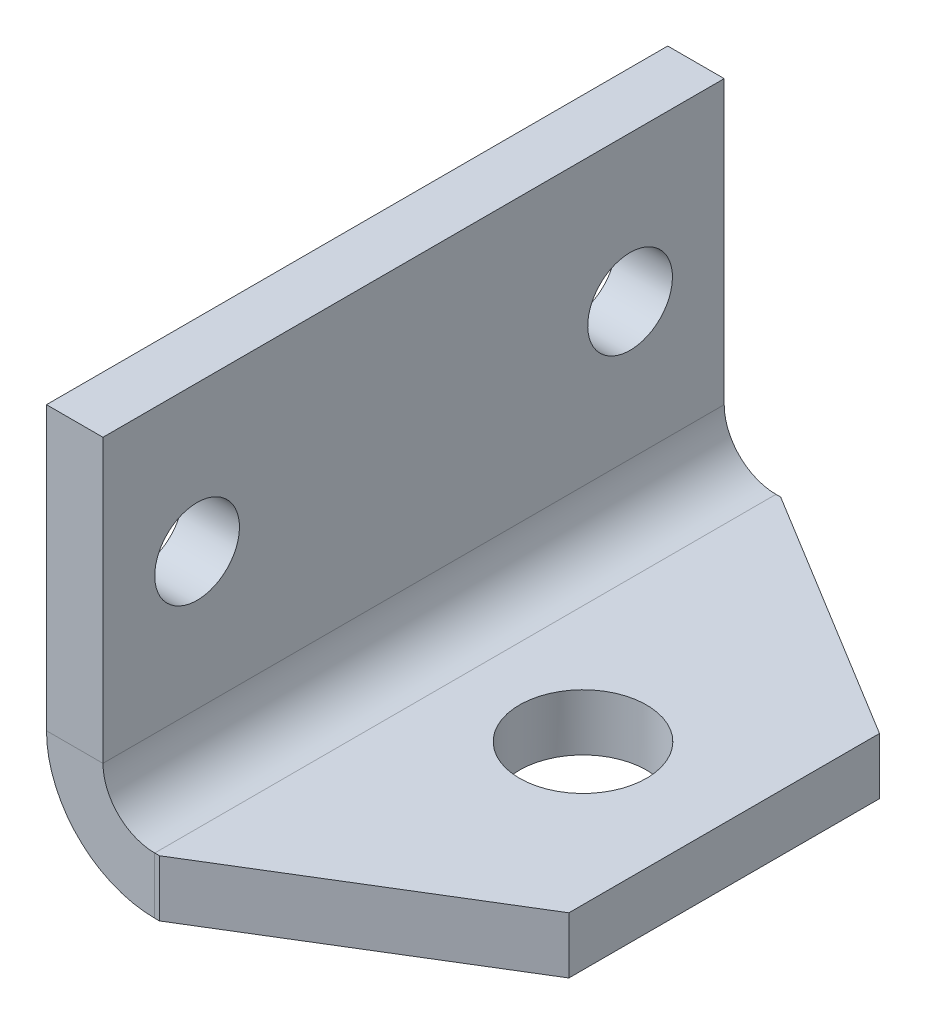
ISO-10303-21;
HEADER;
FILE_DESCRIPTION(('STEP AP214'),'2;1');
FILE_NAME('part.step','',(''),(''),'','','');
FILE_SCHEMA(('AUTOMOTIVE_DESIGN { 1 0 10303 214 1 1 1 1 }'));
ENDSEC;
DATA;
#1=APPLICATION_CONTEXT('core data for automotive mechanical design processes');
#2=APPLICATION_PROTOCOL_DEFINITION('international standard','automotive_design',2000,#1);
#3=PRODUCT_CONTEXT('',#1,'mechanical');
#4=PRODUCT('Part','Part','',(#3));
#5=PRODUCT_RELATED_PRODUCT_CATEGORY('part','',(#4));
#6=PRODUCT_DEFINITION_FORMATION('','',#4);
#7=PRODUCT_DEFINITION_CONTEXT('part definition',#1,'design');
#8=PRODUCT_DEFINITION('design','',#6,#7);
#9=PRODUCT_DEFINITION_SHAPE('','',#8);
#10=(LENGTH_UNIT() NAMED_UNIT(*) SI_UNIT(.MILLI.,.METRE.));
#11=(NAMED_UNIT(*) PLANE_ANGLE_UNIT() SI_UNIT($,.RADIAN.));
#12=(NAMED_UNIT(*) SI_UNIT($,.STERADIAN.) SOLID_ANGLE_UNIT());
#13=UNCERTAINTY_MEASURE_WITH_UNIT(LENGTH_MEASURE(1.E-05),#10,'distance_accuracy_value','');
#14=(GEOMETRIC_REPRESENTATION_CONTEXT(3) GLOBAL_UNCERTAINTY_ASSIGNED_CONTEXT((#13)) GLOBAL_UNIT_ASSIGNED_CONTEXT((#10,
#11,#12)) REPRESENTATION_CONTEXT('',''));
#15=CARTESIAN_POINT('',(0.,0.,0.));
#16=DIRECTION('',(0.,0.,1.));
#17=DIRECTION('',(1.,0.,0.));
#18=AXIS2_PLACEMENT_3D('',#15,#16,#17);
#19=CARTESIAN_POINT('',(0.,0.,-132.));
#20=DIRECTION('',(0.,-1.,0.));
#21=DIRECTION('',(0.,0.,-1.));
#22=AXIS2_PLACEMENT_3D('',#19,#20,#21);
#23=PLANE('',#22);
#24=CARTESIAN_POINT('',(48.,0.,-66.));
#25=DIRECTION('',(0.,-1.,0.));
#26=DIRECTION('',(0.,0.,-1.));
#27=AXIS2_PLACEMENT_3D('',#24,#25,#26);
#28=CIRCLE('',#27,13.5);
#29=CARTESIAN_POINT('',(48.,0.,-79.5));
#30=VERTEX_POINT('',#29);
#31=EDGE_CURVE('E141',#30,#30,#28,.T.);
#32=ORIENTED_EDGE('',*,*,#31,.F.);
#33=EDGE_LOOP('',(#32));
#34=FACE_BOUND('',#33,.T.);
#35=DIRECTION('',(-0.853281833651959,0.,-0.521450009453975));
#36=VECTOR('',#35,1.);
#37=CARTESIAN_POINT('',(6.5258426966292,0.,-142.678651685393));
#38=LINE('',#37,#36);
#39=CARTESIAN_POINT('',(78.,0.,-99.));
#40=VERTEX_POINT('',#39);
#41=CARTESIAN_POINT('',(24.,0.,-132.));
#42=VERTEX_POINT('',#41);
#43=EDGE_CURVE('E47',#40,#42,#38,.T.);
#44=ORIENTED_EDGE('',*,*,#43,.F.);
#45=DIRECTION('',(0.,0.,1.));
#46=VECTOR('',#45,1.);
#47=CARTESIAN_POINT('',(78.,0.,-132.));
#48=LINE('',#47,#46);
#49=CARTESIAN_POINT('',(78.,0.,-33.));
#50=VERTEX_POINT('',#49);
#51=EDGE_CURVE('E145',#40,#50,#48,.T.);
#52=ORIENTED_EDGE('',*,*,#51,.T.);
#53=DIRECTION('',(0.853281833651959,0.,-0.521450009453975));
#54=VECTOR('',#53,1.);
#55=CARTESIAN_POINT('',(65.2584269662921,0.,-25.2134831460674));
#56=LINE('',#55,#54);
#57=CARTESIAN_POINT('',(24.,0.,0.));
#58=VERTEX_POINT('',#57);
#59=EDGE_CURVE('E147',#58,#50,#56,.T.);
#60=ORIENTED_EDGE('',*,*,#59,.F.);
#61=DIRECTION('',(1.,0.,0.));
#62=VECTOR('',#61,1.);
#63=CARTESIAN_POINT('',(0.,0.,0.));
#64=LINE('',#63,#62);
#65=CARTESIAN_POINT('',(23.,0.,0.));
#66=VERTEX_POINT('',#65);
#67=EDGE_CURVE('E150',#66,#58,#64,.T.);
#68=ORIENTED_EDGE('',*,*,#67,.F.);
#69=DIRECTION('',(0.,0.,1.));
#70=VECTOR('',#69,1.);
#71=CARTESIAN_POINT('',(23.,0.,-132.));
#72=LINE('',#71,#70);
#73=CARTESIAN_POINT('',(23.,0.,-132.));
#74=VERTEX_POINT('',#73);
#75=EDGE_CURVE('E152',#66,#74,#72,.F.);
#76=ORIENTED_EDGE('',*,*,#75,.T.);
#77=DIRECTION('',(1.,0.,0.));
#78=VECTOR('',#77,1.);
#79=CARTESIAN_POINT('',(0.,0.,-132.));
#80=LINE('',#79,#78);
#81=EDGE_CURVE('E155',#74,#42,#80,.T.);
#82=ORIENTED_EDGE('',*,*,#81,.T.);
#83=EDGE_LOOP('',(#44,#52,#60,#68,#76,#82));
#84=FACE_BOUND('',#83,.T.);
#85=ADVANCED_FACE('F24',(#34,#84),#23,.T.);
#86=CARTESIAN_POINT('',(48.,-120.,-66.));
#87=DIRECTION('',(0.,1.,0.));
#88=DIRECTION('',(0.,0.,1.));
#89=AXIS2_PLACEMENT_3D('',#86,#87,#88);
#90=CYLINDRICAL_SURFACE('',#89,13.5);
#91=ORIENTED_EDGE('',*,*,#31,.T.);
#92=EDGE_LOOP('',(#91));
#93=FACE_BOUND('',#92,.T.);
#94=CARTESIAN_POINT('',(48.,12.,-66.));
#95=DIRECTION('',(0.,1.,0.));
#96=DIRECTION('',(0.,0.,1.));
#97=AXIS2_PLACEMENT_3D('',#94,#95,#96);
#98=CIRCLE('',#97,13.5);
#99=CARTESIAN_POINT('',(48.,12.,-52.5));
#100=VERTEX_POINT('',#99);
#101=EDGE_CURVE('E187',#100,#100,#98,.T.);
#102=ORIENTED_EDGE('',*,*,#101,.T.);
#103=EDGE_LOOP('',(#102));
#104=FACE_BOUND('',#103,.T.);
#105=ADVANCED_FACE('F243',(#93,#104),#90,.F.);
#106=CARTESIAN_POINT('',(12.,12.,-132.));
#107=DIRECTION('',(0.,1.,0.));
#108=DIRECTION('',(0.,0.,1.));
#109=AXIS2_PLACEMENT_3D('',#106,#107,#108);
#110=PLANE('',#109);
#111=ORIENTED_EDGE('',*,*,#101,.F.);
#112=EDGE_LOOP('',(#111));
#113=FACE_BOUND('',#112,.T.);
#114=DIRECTION('',(0.853281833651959,0.,0.521450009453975));
#115=VECTOR('',#114,1.);
#116=CARTESIAN_POINT('',(78.,12.,-99.));
#117=LINE('',#116,#115);
#118=CARTESIAN_POINT('',(24.,12.,-132.));
#119=VERTEX_POINT('',#118);
#120=CARTESIAN_POINT('',(78.,12.,-99.));
#121=VERTEX_POINT('',#120);
#122=EDGE_CURVE('E224',#119,#121,#117,.T.);
#123=ORIENTED_EDGE('',*,*,#122,.F.);
#124=DIRECTION('',(-1.,0.,0.));
#125=VECTOR('',#124,1.);
#126=CARTESIAN_POINT('',(12.,12.,-132.));
#127=LINE('',#126,#125);
#128=CARTESIAN_POINT('',(23.,12.,-132.));
#129=VERTEX_POINT('',#128);
#130=EDGE_CURVE('E129',#119,#129,#127,.T.);
#131=ORIENTED_EDGE('',*,*,#130,.T.);
#132=DIRECTION('',(0.,0.,1.));
#133=VECTOR('',#132,1.);
#134=CARTESIAN_POINT('',(23.,12.,0.));
#135=LINE('',#134,#133);
#136=CARTESIAN_POINT('',(23.,12.,0.));
#137=VERTEX_POINT('',#136);
#138=EDGE_CURVE('E118',#129,#137,#135,.T.);
#139=ORIENTED_EDGE('',*,*,#138,.T.);
#140=DIRECTION('',(-1.,0.,0.));
#141=VECTOR('',#140,1.);
#142=CARTESIAN_POINT('',(12.,12.,0.));
#143=LINE('',#142,#141);
#144=CARTESIAN_POINT('',(24.,12.,0.));
#145=VERTEX_POINT('',#144);
#146=EDGE_CURVE('E127',#145,#137,#143,.T.);
#147=ORIENTED_EDGE('',*,*,#146,.F.);
#148=DIRECTION('',(-0.853281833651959,0.,0.521450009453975));
#149=VECTOR('',#148,1.);
#150=CARTESIAN_POINT('',(73.9955056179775,12.,-30.5528089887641));
#151=LINE('',#150,#149);
#152=CARTESIAN_POINT('',(78.,12.,-33.));
#153=VERTEX_POINT('',#152);
#154=EDGE_CURVE('E39',#153,#145,#151,.T.);
#155=ORIENTED_EDGE('',*,*,#154,.F.);
#156=DIRECTION('',(0.,0.,1.));
#157=VECTOR('',#156,1.);
#158=CARTESIAN_POINT('',(78.,12.,-132.));
#159=LINE('',#158,#157);
#160=EDGE_CURVE('E136',#121,#153,#159,.T.);
#161=ORIENTED_EDGE('',*,*,#160,.F.);
#162=EDGE_LOOP('',(#123,#131,#139,#147,#155,#161));
#163=FACE_BOUND('',#162,.T.);
#164=ADVANCED_FACE('F126',(#113,#163),#110,.T.);
#165=CARTESIAN_POINT('',(78.,298.,-99.));
#166=DIRECTION('',(0.521450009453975,0.,-0.853281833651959));
#167=DIRECTION('',(-0.853281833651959,0.,-0.521450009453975));
#168=AXIS2_PLACEMENT_3D('',#165,#166,#167);
#169=PLANE('',#168);
#170=DIRECTION('',(0.,-1.,0.));
#171=VECTOR('',#170,1.);
#172=CARTESIAN_POINT('',(78.,298.,-99.));
#173=LINE('',#172,#171);
#174=EDGE_CURVE('E157',#121,#40,#173,.T.);
#175=ORIENTED_EDGE('',*,*,#174,.T.);
#176=ORIENTED_EDGE('',*,*,#43,.T.);
#177=DIRECTION('',(0.,-1.,0.));
#178=VECTOR('',#177,1.);
#179=CARTESIAN_POINT('',(24.,298.,-132.));
#180=LINE('',#179,#178);
#181=EDGE_CURVE('E11',#119,#42,#180,.T.);
#182=ORIENTED_EDGE('',*,*,#181,.F.);
#183=ORIENTED_EDGE('',*,*,#122,.T.);
#184=EDGE_LOOP('',(#175,#176,#182,#183));
#185=FACE_BOUND('',#184,.T.);
#186=ADVANCED_FACE('F26',(#185),#169,.T.);
#187=CARTESIAN_POINT('',(12.,298.,-132.));
#188=DIRECTION('',(0.,0.,1.));
#189=DIRECTION('',(0.,1.,0.));
#190=AXIS2_PLACEMENT_3D('',#187,#188,#189);
#191=PLANE('',#190);
#192=ORIENTED_EDGE('',*,*,#81,.F.);
#193=DIRECTION('',(0.,-1.,0.));
#194=VECTOR('',#193,1.);
#195=CARTESIAN_POINT('',(23.,298.,-132.));
#196=LINE('',#195,#194);
#197=EDGE_CURVE('E32',#129,#74,#196,.T.);
#198=ORIENTED_EDGE('',*,*,#197,.F.);
#199=ORIENTED_EDGE('',*,*,#130,.F.);
#200=ORIENTED_EDGE('',*,*,#181,.T.);
#201=EDGE_LOOP('',(#192,#198,#199,#200));
#202=FACE_BOUND('',#201,.T.);
#203=ADVANCED_FACE('F171',(#202),#191,.F.);
#204=CARTESIAN_POINT('',(12.,298.,0.));
#205=DIRECTION('',(0.,0.,1.));
#206=DIRECTION('',(0.,1.,0.));
#207=AXIS2_PLACEMENT_3D('',#204,#205,#206);
#208=PLANE('',#207);
#209=DIRECTION('',(0.,-1.,0.));
#210=VECTOR('',#209,1.);
#211=CARTESIAN_POINT('',(23.,298.,0.));
#212=LINE('',#211,#210);
#213=EDGE_CURVE('E101',#137,#66,#212,.T.);
#214=ORIENTED_EDGE('',*,*,#213,.T.);
#215=ORIENTED_EDGE('',*,*,#67,.T.);
#216=DIRECTION('',(0.,-1.,0.));
#217=VECTOR('',#216,1.);
#218=CARTESIAN_POINT('',(24.,298.,0.));
#219=LINE('',#218,#217);
#220=EDGE_CURVE('E112',#145,#58,#219,.T.);
#221=ORIENTED_EDGE('',*,*,#220,.F.);
#222=ORIENTED_EDGE('',*,*,#146,.T.);
#223=EDGE_LOOP('',(#214,#215,#221,#222));
#224=FACE_BOUND('',#223,.T.);
#225=ADVANCED_FACE('F133',(#224),#208,.T.);
#226=CARTESIAN_POINT('',(73.9955056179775,298.,-30.5528089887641));
#227=DIRECTION('',(0.521450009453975,0.,0.853281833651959));
#228=DIRECTION('',(0.853281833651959,0.,-0.521450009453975));
#229=AXIS2_PLACEMENT_3D('',#226,#227,#228);
#230=PLANE('',#229);
#231=ORIENTED_EDGE('',*,*,#220,.T.);
#232=ORIENTED_EDGE('',*,*,#59,.T.);
#233=DIRECTION('',(0.,-1.,0.));
#234=VECTOR('',#233,1.);
#235=CARTESIAN_POINT('',(78.,298.,-33.));
#236=LINE('',#235,#234);
#237=EDGE_CURVE('E160',#153,#50,#236,.T.);
#238=ORIENTED_EDGE('',*,*,#237,.F.);
#239=ORIENTED_EDGE('',*,*,#154,.T.);
#240=EDGE_LOOP('',(#231,#232,#238,#239));
#241=FACE_BOUND('',#240,.T.);
#242=ADVANCED_FACE('F232',(#241),#230,.T.);
#243=CARTESIAN_POINT('',(78.,298.,-132.));
#244=DIRECTION('',(1.,0.,0.));
#245=DIRECTION('',(0.,1.,0.));
#246=AXIS2_PLACEMENT_3D('',#243,#244,#245);
#247=PLANE('',#246);
#248=ORIENTED_EDGE('',*,*,#237,.T.);
#249=ORIENTED_EDGE('',*,*,#51,.F.);
#250=ORIENTED_EDGE('',*,*,#174,.F.);
#251=ORIENTED_EDGE('',*,*,#160,.T.);
#252=EDGE_LOOP('',(#248,#249,#250,#251));
#253=FACE_BOUND('',#252,.T.);
#254=ADVANCED_FACE('F229',(#253),#247,.T.);
#255=CARTESIAN_POINT('',(301.99310336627,83.,-132.));
#256=DIRECTION('',(0.,-1.,0.));
#257=DIRECTION('',(1.,0.,0.));
#258=AXIS2_PLACEMENT_3D('',#255,#256,#257);
#259=PLANE('',#258);
#260=DIRECTION('',(0.,0.,1.));
#261=VECTOR('',#260,1.);
#262=CARTESIAN_POINT('',(0.,83.,-132.));
#263=LINE('',#262,#261);
#264=CARTESIAN_POINT('',(0.,83.,-132.));
#265=VERTEX_POINT('',#264);
#266=CARTESIAN_POINT('',(0.,83.,0.));
#267=VERTEX_POINT('',#266);
#268=EDGE_CURVE('E179',#265,#267,#263,.T.);
#269=ORIENTED_EDGE('',*,*,#268,.T.);
#270=DIRECTION('',(-1.,0.,0.));
#271=VECTOR('',#270,1.);
#272=CARTESIAN_POINT('',(301.99310336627,83.,0.));
#273=LINE('',#272,#271);
#274=CARTESIAN_POINT('',(12.,83.,0.));
#275=VERTEX_POINT('',#274);
#276=EDGE_CURVE('E191',#275,#267,#273,.T.);
#277=ORIENTED_EDGE('',*,*,#276,.F.);
#278=DIRECTION('',(0.,0.,1.));
#279=VECTOR('',#278,1.);
#280=CARTESIAN_POINT('',(12.,83.,-132.));
#281=LINE('',#280,#279);
#282=CARTESIAN_POINT('',(12.,83.,-132.));
#283=VERTEX_POINT('',#282);
#284=EDGE_CURVE('E200',#283,#275,#281,.T.);
#285=ORIENTED_EDGE('',*,*,#284,.F.);
#286=DIRECTION('',(-1.,0.,0.));
#287=VECTOR('',#286,1.);
#288=CARTESIAN_POINT('',(301.99310336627,83.,-132.));
#289=LINE('',#288,#287);
#290=EDGE_CURVE('E219',#283,#265,#289,.T.);
#291=ORIENTED_EDGE('',*,*,#290,.T.);
#292=EDGE_LOOP('',(#269,#277,#285,#291));
#293=FACE_BOUND('',#292,.T.);
#294=ADVANCED_FACE('F239',(#293),#259,.F.);
#295=CARTESIAN_POINT('',(-120.,52.,-20.));
#296=DIRECTION('',(1.,0.,0.));
#297=DIRECTION('',(0.,1.,0.));
#298=AXIS2_PLACEMENT_3D('',#295,#296,#297);
#299=CYLINDRICAL_SURFACE('',#298,9.);
#300=CARTESIAN_POINT('',(0.,52.,-20.));
#301=DIRECTION('',(-1.,0.,0.));
#302=DIRECTION('',(0.,0.,1.));
#303=AXIS2_PLACEMENT_3D('',#300,#301,#302);
#304=CIRCLE('',#303,9.);
#305=CARTESIAN_POINT('',(0.,52.,-11.));
#306=VERTEX_POINT('',#305);
#307=EDGE_CURVE('E216',#306,#306,#304,.T.);
#308=ORIENTED_EDGE('',*,*,#307,.T.);
#309=EDGE_LOOP('',(#308));
#310=FACE_BOUND('',#309,.T.);
#311=CARTESIAN_POINT('',(12.,52.,-20.));
#312=DIRECTION('',(1.,0.,0.));
#313=DIRECTION('',(0.,1.,0.));
#314=AXIS2_PLACEMENT_3D('',#311,#312,#313);
#315=CIRCLE('',#314,9.);
#316=CARTESIAN_POINT('',(12.,61.,-20.));
#317=VERTEX_POINT('',#316);
#318=EDGE_CURVE('E213',#317,#317,#315,.T.);
#319=ORIENTED_EDGE('',*,*,#318,.T.);
#320=EDGE_LOOP('',(#319));
#321=FACE_BOUND('',#320,.T.);
#322=ADVANCED_FACE('F285',(#310,#321),#299,.F.);
#323=CARTESIAN_POINT('',(-120.,52.,-112.));
#324=DIRECTION('',(1.,0.,0.));
#325=DIRECTION('',(0.,1.,0.));
#326=AXIS2_PLACEMENT_3D('',#323,#324,#325);
#327=CYLINDRICAL_SURFACE('',#326,9.);
#328=CARTESIAN_POINT('',(0.,52.,-112.));
#329=DIRECTION('',(-1.,0.,0.));
#330=DIRECTION('',(0.,0.,1.));
#331=AXIS2_PLACEMENT_3D('',#328,#329,#330);
#332=CIRCLE('',#331,9.);
#333=CARTESIAN_POINT('',(0.,52.,-103.));
#334=VERTEX_POINT('',#333);
#335=EDGE_CURVE('E210',#334,#334,#332,.T.);
#336=ORIENTED_EDGE('',*,*,#335,.T.);
#337=EDGE_LOOP('',(#336));
#338=FACE_BOUND('',#337,.T.);
#339=CARTESIAN_POINT('',(12.,52.,-112.));
#340=DIRECTION('',(1.,0.,0.));
#341=DIRECTION('',(0.,1.,0.));
#342=AXIS2_PLACEMENT_3D('',#339,#340,#341);
#343=CIRCLE('',#342,9.);
#344=CARTESIAN_POINT('',(12.,61.,-112.));
#345=VERTEX_POINT('',#344);
#346=EDGE_CURVE('E207',#345,#345,#343,.T.);
#347=ORIENTED_EDGE('',*,*,#346,.T.);
#348=EDGE_LOOP('',(#347));
#349=FACE_BOUND('',#348,.T.);
#350=ADVANCED_FACE('F281',(#338,#349),#327,.F.);
#351=CARTESIAN_POINT('',(12.,83.,-132.));
#352=DIRECTION('',(1.,0.,0.));
#353=DIRECTION('',(0.,1.,0.));
#354=AXIS2_PLACEMENT_3D('',#351,#352,#353);
#355=PLANE('',#354);
#356=ORIENTED_EDGE('',*,*,#346,.F.);
#357=EDGE_LOOP('',(#356));
#358=FACE_BOUND('',#357,.T.);
#359=ORIENTED_EDGE('',*,*,#318,.F.);
#360=EDGE_LOOP('',(#359));
#361=FACE_BOUND('',#360,.T.);
#362=DIRECTION('',(0.,1.,0.));
#363=VECTOR('',#362,1.);
#364=CARTESIAN_POINT('',(12.,83.,0.));
#365=LINE('',#364,#363);
#366=CARTESIAN_POINT('',(12.,23.,0.));
#367=VERTEX_POINT('',#366);
#368=EDGE_CURVE('E184',#367,#275,#365,.T.);
#369=ORIENTED_EDGE('',*,*,#368,.F.);
#370=DIRECTION('',(0.,0.,1.));
#371=VECTOR('',#370,1.);
#372=CARTESIAN_POINT('',(12.,23.,-132.));
#373=LINE('',#372,#371);
#374=CARTESIAN_POINT('',(12.,23.,-132.));
#375=VERTEX_POINT('',#374);
#376=EDGE_CURVE('E121',#367,#375,#373,.F.);
#377=ORIENTED_EDGE('',*,*,#376,.T.);
#378=DIRECTION('',(0.,1.,0.));
#379=VECTOR('',#378,1.);
#380=CARTESIAN_POINT('',(12.,83.,-132.));
#381=LINE('',#380,#379);
#382=EDGE_CURVE('E203',#375,#283,#381,.T.);
#383=ORIENTED_EDGE('',*,*,#382,.T.);
#384=ORIENTED_EDGE('',*,*,#284,.T.);
#385=EDGE_LOOP('',(#369,#377,#383,#384));
#386=FACE_BOUND('',#385,.T.);
#387=ADVANCED_FACE('F277',(#358,#361,#386),#355,.T.);
#388=CARTESIAN_POINT('',(301.99310336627,83.,-132.));
#389=DIRECTION('',(0.,0.,1.));
#390=DIRECTION('',(1.,0.,0.));
#391=AXIS2_PLACEMENT_3D('',#388,#389,#390);
#392=PLANE('',#391);
#393=DIRECTION('',(0.,-1.,0.));
#394=VECTOR('',#393,1.);
#395=CARTESIAN_POINT('',(0.,0.,-132.));
#396=LINE('',#395,#394);
#397=CARTESIAN_POINT('',(0.,23.,-132.));
#398=VERTEX_POINT('',#397);
#399=EDGE_CURVE('E195',#265,#398,#396,.T.);
#400=ORIENTED_EDGE('',*,*,#399,.F.);
#401=ORIENTED_EDGE('',*,*,#290,.F.);
#402=ORIENTED_EDGE('',*,*,#382,.F.);
#403=DIRECTION('',(-1.,0.,0.));
#404=VECTOR('',#403,1.);
#405=CARTESIAN_POINT('',(301.99310336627,23.,-132.));
#406=LINE('',#405,#404);
#407=EDGE_CURVE('E198',#375,#398,#406,.T.);
#408=ORIENTED_EDGE('',*,*,#407,.T.);
#409=EDGE_LOOP('',(#400,#401,#402,#408));
#410=FACE_BOUND('',#409,.T.);
#411=ADVANCED_FACE('F273',(#410),#392,.F.);
#412=CARTESIAN_POINT('',(0.,0.,-132.));
#413=DIRECTION('',(-1.,0.,0.));
#414=DIRECTION('',(0.,0.,1.));
#415=AXIS2_PLACEMENT_3D('',#412,#413,#414);
#416=PLANE('',#415);
#417=ORIENTED_EDGE('',*,*,#335,.F.);
#418=EDGE_LOOP('',(#417));
#419=FACE_BOUND('',#418,.T.);
#420=ORIENTED_EDGE('',*,*,#307,.F.);
#421=EDGE_LOOP('',(#420));
#422=FACE_BOUND('',#421,.T.);
#423=ORIENTED_EDGE('',*,*,#399,.T.);
#424=DIRECTION('',(0.,0.,1.));
#425=VECTOR('',#424,1.);
#426=CARTESIAN_POINT('',(0.,23.,-132.));
#427=LINE('',#426,#425);
#428=CARTESIAN_POINT('',(0.,23.,0.));
#429=VERTEX_POINT('',#428);
#430=EDGE_CURVE('E176',#398,#429,#427,.T.);
#431=ORIENTED_EDGE('',*,*,#430,.T.);
#432=DIRECTION('',(0.,-1.,0.));
#433=VECTOR('',#432,1.);
#434=CARTESIAN_POINT('',(0.,0.,0.));
#435=LINE('',#434,#433);
#436=EDGE_CURVE('E188',#267,#429,#435,.T.);
#437=ORIENTED_EDGE('',*,*,#436,.F.);
#438=ORIENTED_EDGE('',*,*,#268,.F.);
#439=EDGE_LOOP('',(#423,#431,#437,#438));
#440=FACE_BOUND('',#439,.T.);
#441=ADVANCED_FACE('F269',(#419,#422,#440),#416,.T.);
#442=CARTESIAN_POINT('',(301.99310336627,83.,0.));
#443=DIRECTION('',(0.,0.,1.));
#444=DIRECTION('',(1.,0.,0.));
#445=AXIS2_PLACEMENT_3D('',#442,#443,#444);
#446=PLANE('',#445);
#447=ORIENTED_EDGE('',*,*,#276,.T.);
#448=ORIENTED_EDGE('',*,*,#436,.T.);
#449=DIRECTION('',(-1.,0.,0.));
#450=VECTOR('',#449,1.);
#451=CARTESIAN_POINT('',(301.99310336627,23.,0.));
#452=LINE('',#451,#450);
#453=EDGE_CURVE('E177',#367,#429,#452,.T.);
#454=ORIENTED_EDGE('',*,*,#453,.F.);
#455=ORIENTED_EDGE('',*,*,#368,.T.);
#456=EDGE_LOOP('',(#447,#448,#454,#455));
#457=FACE_BOUND('',#456,.T.);
#458=ADVANCED_FACE('F256',(#457),#446,.T.);
#459=CARTESIAN_POINT('',(23.,23.,-132.));
#460=DIRECTION('',(0.,0.,-1.));
#461=DIRECTION('',(-1.,0.,0.));
#462=AXIS2_PLACEMENT_3D('',#459,#460,#461);
#463=PLANE('',#462);
#464=ORIENTED_EDGE('',*,*,#407,.F.);
#465=CARTESIAN_POINT('',(23.,23.,-132.));
#466=DIRECTION('',(0.,0.,-1.));
#467=DIRECTION('',(-1.,0.,0.));
#468=AXIS2_PLACEMENT_3D('',#465,#466,#467);
#469=CIRCLE('',#468,11.);
#470=EDGE_CURVE('E123',#375,#129,#469,.F.);
#471=ORIENTED_EDGE('',*,*,#470,.T.);
#472=ORIENTED_EDGE('',*,*,#197,.T.);
#473=CARTESIAN_POINT('',(23.,23.,-132.));
#474=DIRECTION('',(0.,0.,-1.));
#475=DIRECTION('',(-1.,0.,0.));
#476=AXIS2_PLACEMENT_3D('',#473,#474,#475);
#477=CIRCLE('',#476,23.);
#478=EDGE_CURVE('E168',#398,#74,#477,.F.);
#479=ORIENTED_EDGE('',*,*,#478,.F.);
#480=EDGE_LOOP('',(#464,#471,#472,#479));
#481=FACE_BOUND('',#480,.T.);
#482=ADVANCED_FACE('F167',(#481),#463,.T.);
#483=CARTESIAN_POINT('',(23.,23.,0.));
#484=DIRECTION('',(0.,0.,1.));
#485=DIRECTION('',(1.,0.,0.));
#486=AXIS2_PLACEMENT_3D('',#483,#484,#485);
#487=PLANE('',#486);
#488=ORIENTED_EDGE('',*,*,#213,.F.);
#489=CARTESIAN_POINT('',(23.,23.,0.));
#490=DIRECTION('',(0.,0.,-1.));
#491=DIRECTION('',(-1.,0.,0.));
#492=AXIS2_PLACEMENT_3D('',#489,#490,#491);
#493=CIRCLE('',#492,11.);
#494=EDGE_CURVE('E104',#137,#367,#493,.T.);
#495=ORIENTED_EDGE('',*,*,#494,.T.);
#496=ORIENTED_EDGE('',*,*,#453,.T.);
#497=CARTESIAN_POINT('',(23.,23.,0.));
#498=DIRECTION('',(0.,0.,-1.));
#499=DIRECTION('',(-1.,0.,0.));
#500=AXIS2_PLACEMENT_3D('',#497,#498,#499);
#501=CIRCLE('',#500,23.);
#502=EDGE_CURVE('E107',#66,#429,#501,.T.);
#503=ORIENTED_EDGE('',*,*,#502,.F.);
#504=EDGE_LOOP('',(#488,#495,#496,#503));
#505=FACE_BOUND('',#504,.T.);
#506=ADVANCED_FACE('F103',(#505),#487,.T.);
#507=CARTESIAN_POINT('',(23.,23.,194.030648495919));
#508=DIRECTION('',(0.,0.,-1.));
#509=DIRECTION('',(-1.,0.,0.));
#510=AXIS2_PLACEMENT_3D('',#507,#508,#509);
#511=CYLINDRICAL_SURFACE('',#510,23.);
#512=ORIENTED_EDGE('',*,*,#502,.T.);
#513=ORIENTED_EDGE('',*,*,#430,.F.);
#514=ORIENTED_EDGE('',*,*,#478,.T.);
#515=ORIENTED_EDGE('',*,*,#75,.F.);
#516=EDGE_LOOP('',(#512,#513,#514,#515));
#517=FACE_BOUND('',#516,.T.);
#518=ADVANCED_FACE('F174',(#517),#511,.T.);
#519=CARTESIAN_POINT('',(23.,23.,194.030648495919));
#520=DIRECTION('',(0.,0.,-1.));
#521=DIRECTION('',(-1.,0.,0.));
#522=AXIS2_PLACEMENT_3D('',#519,#520,#521);
#523=CYLINDRICAL_SURFACE('',#522,11.);
#524=ORIENTED_EDGE('',*,*,#494,.F.);
#525=ORIENTED_EDGE('',*,*,#138,.F.);
#526=ORIENTED_EDGE('',*,*,#470,.F.);
#527=ORIENTED_EDGE('',*,*,#376,.F.);
#528=EDGE_LOOP('',(#524,#525,#526,#527));
#529=FACE_BOUND('',#528,.T.);
#530=ADVANCED_FACE('F116',(#529),#523,.F.);
#531=CLOSED_SHELL('',(#85,#105,#164,#186,#203,#225,#242,#254,#294,#322,#350,#387,#411,#441,#458,
#482,#506,#518,#530));
#532=MANIFOLD_SOLID_BREP('B2',#531);
#533=ADVANCED_BREP_SHAPE_REPRESENTATION('',(#18,#532),#14);
#534=SHAPE_DEFINITION_REPRESENTATION(#9,#533);
ENDSEC;
END-ISO-10303-21;
